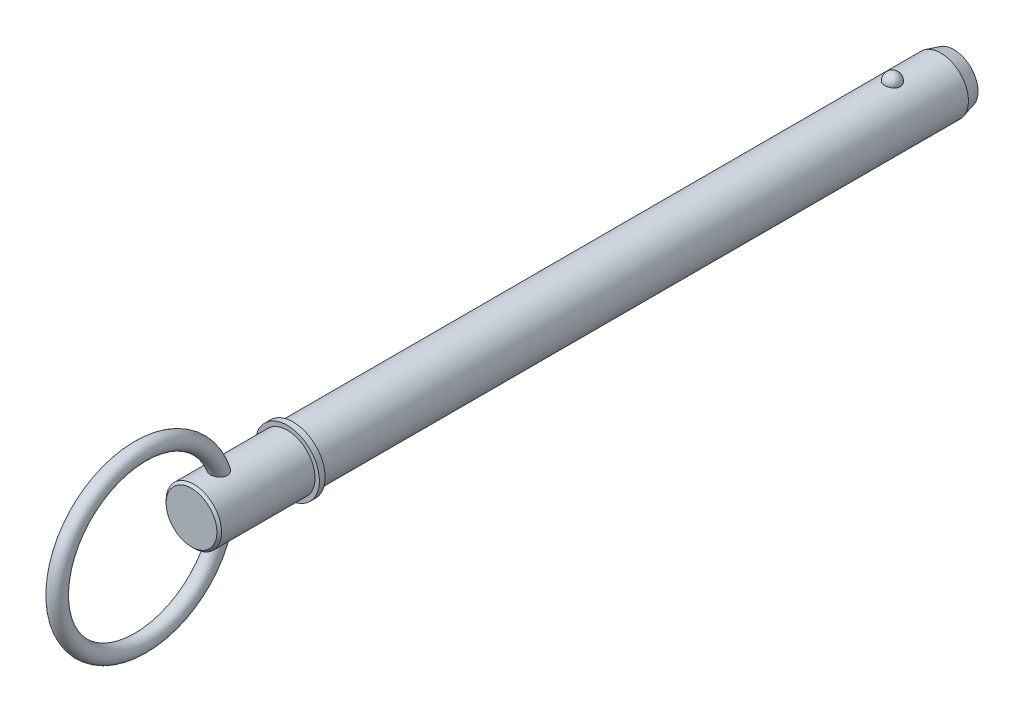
ISO-10303-21;
HEADER;
FILE_DESCRIPTION(('STEP AP214'),'2;1');
FILE_NAME('part.step','',(''),(''),'','','');
FILE_SCHEMA(('AUTOMOTIVE_DESIGN { 1 0 10303 214 1 1 1 1 }'));
ENDSEC;
DATA;
#1=APPLICATION_CONTEXT('core data for automotive mechanical design processes');
#2=APPLICATION_PROTOCOL_DEFINITION('international standard','automotive_design',2000,#1);
#3=PRODUCT_CONTEXT('',#1,'mechanical');
#4=PRODUCT('Part','Part','',(#3));
#5=PRODUCT_RELATED_PRODUCT_CATEGORY('part','',(#4));
#6=PRODUCT_DEFINITION_FORMATION('','',#4);
#7=PRODUCT_DEFINITION_CONTEXT('part definition',#1,'design');
#8=PRODUCT_DEFINITION('design','',#6,#7);
#9=PRODUCT_DEFINITION_SHAPE('','',#8);
#10=(LENGTH_UNIT() NAMED_UNIT(*) SI_UNIT(.MILLI.,.METRE.));
#11=(NAMED_UNIT(*) PLANE_ANGLE_UNIT() SI_UNIT($,.RADIAN.));
#12=(NAMED_UNIT(*) SI_UNIT($,.STERADIAN.) SOLID_ANGLE_UNIT());
#13=UNCERTAINTY_MEASURE_WITH_UNIT(LENGTH_MEASURE(1.E-05),#10,'distance_accuracy_value','');
#14=(GEOMETRIC_REPRESENTATION_CONTEXT(3) GLOBAL_UNCERTAINTY_ASSIGNED_CONTEXT((#13)) GLOBAL_UNIT_ASSIGNED_CONTEXT((#10,
#11,#12)) REPRESENTATION_CONTEXT('',''));
#15=CARTESIAN_POINT('',(0.,0.,0.));
#16=DIRECTION('',(0.,0.,1.));
#17=DIRECTION('',(1.,0.,0.));
#18=AXIS2_PLACEMENT_3D('',#15,#16,#17);
#19=CARTESIAN_POINT('',(0.,0.,203.2));
#20=DIRECTION('',(0.,0.,-1.));
#21=DIRECTION('',(-1.,0.,0.));
#22=AXIS2_PLACEMENT_3D('',#19,#20,#21);
#23=CYLINDRICAL_SURFACE('',#22,9.525);
#24=CARTESIAN_POINT('',(2.66304631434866,9.14515223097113,-2.68999999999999));
#25=CARTESIAN_POINT('',(2.66304388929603,9.14515434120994,-2.53964785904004));
#26=CARTESIAN_POINT('',(2.65079171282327,9.14874785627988,-2.38926509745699));
#27=CARTESIAN_POINT('',(2.60207590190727,9.16272073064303,-2.09276319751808));
#28=CARTESIAN_POINT('',(2.5656035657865,9.17310252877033,-1.94664561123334));
#29=CARTESIAN_POINT('',(2.469373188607,9.19947238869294,-1.66290124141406));
#30=CARTESIAN_POINT('',(2.40962536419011,9.215457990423,-1.52527076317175));
#31=CARTESIAN_POINT('',(2.26832639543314,9.25124900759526,-1.26225231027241));
#32=CARTESIAN_POINT('',(2.1867756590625,9.27105435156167,-1.13686410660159));
#33=CARTESIAN_POINT('',(2.00344089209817,9.3123948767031,-0.901158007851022));
#34=CARTESIAN_POINT('',(1.90155748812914,9.33393823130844,-0.790918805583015));
#35=CARTESIAN_POINT('',(1.68043702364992,9.37626794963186,-0.589299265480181));
#36=CARTESIAN_POINT('',(1.56119995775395,9.397054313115,-0.497918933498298));
#37=CARTESIAN_POINT('',(1.30893044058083,9.43549335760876,-0.336812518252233));
#38=CARTESIAN_POINT('',(1.17593917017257,9.45315498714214,-0.267024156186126));
#39=CARTESIAN_POINT('',(0.8995966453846,9.48344056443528,-0.150749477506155));
#40=CARTESIAN_POINT('',(0.756246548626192,9.49606507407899,-0.104260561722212));
#41=CARTESIAN_POINT('',(0.466048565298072,9.51468193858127,-0.0365733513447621));
#42=CARTESIAN_POINT('',(0.319312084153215,9.52079100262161,-0.014929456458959));
#43=CARTESIAN_POINT('',(0.0241592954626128,9.52611235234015,0.00395337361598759));
#44=CARTESIAN_POINT('',(-0.124256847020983,9.5253253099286,0.00119468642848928));
#45=CARTESIAN_POINT('',(-0.41628168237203,9.51700443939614,-0.0284230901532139));
#46=CARTESIAN_POINT('',(-0.559928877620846,9.50956858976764,-0.0549321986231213));
#47=CARTESIAN_POINT('',(-0.840604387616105,9.48887888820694,-0.130816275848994));
#48=CARTESIAN_POINT('',(-0.977632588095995,9.47562493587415,-0.180191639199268));
#49=CARTESIAN_POINT('',(-1.24212223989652,9.44460733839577,-0.300803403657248));
#50=CARTESIAN_POINT('',(-1.36952298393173,9.42681774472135,-0.372166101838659));
#51=CARTESIAN_POINT('',(-1.61053183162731,9.38864858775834,-0.534729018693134));
#52=CARTESIAN_POINT('',(-1.72413851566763,9.36826875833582,-0.625931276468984));
#53=CARTESIAN_POINT('',(-1.9367483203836,9.32666137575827,-0.827716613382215));
#54=CARTESIAN_POINT('',(-2.03542624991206,9.3054250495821,-0.938640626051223));
#55=CARTESIAN_POINT('',(-2.21301001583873,9.26480083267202,-1.17562728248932));
#56=CARTESIAN_POINT('',(-2.29191442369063,9.24541307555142,-1.3016910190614));
#57=CARTESIAN_POINT('',(-2.4288038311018,9.21040769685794,-1.56709947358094));
#58=CARTESIAN_POINT('',(-2.48653332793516,9.19483682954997,-1.70658229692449));
#59=CARTESIAN_POINT('',(-2.57830950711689,9.16952722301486,-1.99363485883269));
#60=CARTESIAN_POINT('',(-2.61235688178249,9.1597883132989,-2.14120436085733));
#61=CARTESIAN_POINT('',(-2.65582131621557,9.14728131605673,-2.43957517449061));
#62=CARTESIAN_POINT('',(-2.66534248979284,9.14448376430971,-2.59036007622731));
#63=CARTESIAN_POINT('',(-2.659816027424,9.1460926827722,-2.89143694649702));
#64=CARTESIAN_POINT('',(-2.64476907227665,9.15049895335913,-3.04172892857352));
#65=CARTESIAN_POINT('',(-2.59062526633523,9.16597303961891,-3.3367616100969));
#66=CARTESIAN_POINT('',(-2.55165119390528,9.17700684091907,-3.48152666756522));
#67=CARTESIAN_POINT('',(-2.45072334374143,9.20447158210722,-3.7622672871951));
#68=CARTESIAN_POINT('',(-2.38876863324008,9.22090274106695,-3.89824249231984));
#69=CARTESIAN_POINT('',(-2.24300082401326,9.25744165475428,-4.15838266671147));
#70=CARTESIAN_POINT('',(-2.15906901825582,9.27756919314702,-4.28247834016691));
#71=CARTESIAN_POINT('',(-1.97161008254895,9.31920445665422,-4.51460755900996));
#72=CARTESIAN_POINT('',(-1.86808218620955,9.34071223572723,-4.62264047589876));
#73=CARTESIAN_POINT('',(-1.64365852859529,9.38280712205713,-4.82005417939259));
#74=CARTESIAN_POINT('',(-1.52269814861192,9.40339041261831,-4.90936239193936));
#75=CARTESIAN_POINT('',(-1.26696810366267,9.44124442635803,-5.06628635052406));
#76=CARTESIAN_POINT('',(-1.13219941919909,9.45851538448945,-5.13390363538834));
#77=CARTESIAN_POINT('',(-0.854427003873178,9.48761400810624,-5.24478918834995));
#78=CARTESIAN_POINT('',(-0.711548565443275,9.49950757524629,-5.28835378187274));
#79=CARTESIAN_POINT('',(-0.420167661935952,9.51684639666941,-5.35116010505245));
#80=CARTESIAN_POINT('',(-0.271665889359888,9.52229244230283,-5.3704048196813));
#81=CARTESIAN_POINT('',(0.0236961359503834,9.52609381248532,-5.38387805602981));
#82=CARTESIAN_POINT('',(0.170533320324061,9.52458300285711,-5.37857884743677));
#83=CARTESIAN_POINT('',(0.461166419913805,9.51494050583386,-5.34419624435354));
#84=CARTESIAN_POINT('',(0.604962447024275,9.50680906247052,-5.31511372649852));
#85=CARTESIAN_POINT('',(0.884899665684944,9.48484202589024,-5.23415185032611));
#86=CARTESIAN_POINT('',(1.02106863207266,9.47102889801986,-5.18236222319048));
#87=CARTESIAN_POINT('',(1.28268503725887,9.43915933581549,-5.05742910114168));
#88=CARTESIAN_POINT('',(1.40813178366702,9.421102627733,-4.98428422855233));
#89=CARTESIAN_POINT('',(1.64690915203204,9.38233399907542,-4.8172920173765));
#90=CARTESIAN_POINT('',(1.76002050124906,9.36158508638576,-4.72313982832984));
#91=CARTESIAN_POINT('',(1.96897358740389,9.31987907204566,-4.51732444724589));
#92=CARTESIAN_POINT('',(2.06481234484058,9.29892193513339,-4.40565824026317));
#93=CARTESIAN_POINT('',(2.23837433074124,9.25869342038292,-4.16566572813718));
#94=CARTESIAN_POINT('',(2.31574652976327,9.23945848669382,-4.03707931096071));
#95=CARTESIAN_POINT('',(2.44818540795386,9.20525491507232,-3.76840633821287));
#96=CARTESIAN_POINT('',(2.50325979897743,9.19028480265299,-3.6283237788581));
#97=CARTESIAN_POINT('',(2.58510224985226,9.16757716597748,-3.35610038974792));
#98=CARTESIAN_POINT('',(2.61427951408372,9.15923447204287,-3.2247283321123));
#99=CARTESIAN_POINT('',(2.6532524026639,9.14802112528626,-2.95891229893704));
#100=CARTESIAN_POINT('',(2.66304848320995,9.1451503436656,-2.82446839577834));
#101=CARTESIAN_POINT('',(2.66304631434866,9.14515223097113,-2.68999999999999));
#102=B_SPLINE_CURVE_WITH_KNOTS('',3,(#24,#25,#26,#27,#28,#29,#30,#31,#32,#33,#34,#35,#36,#37,
#38,#39,#40,#41,#42,#43,#44,#45,#46,#47,#48,#49,#50,#51,#52,#53,#54,#55,#56,#57,#58,#59,#60,#61,
#62,#63,#64,#65,#66,#67,#68,#69,#70,#71,#72,#73,#74,#75,#76,#77,#78,#79,#80,#81,#82,#83,#84,#85,
#86,#87,#88,#89,#90,#91,#92,#93,#94,#95,#96,#97,#98,#99,#100,#101),.UNSPECIFIED.,.T.,.F.,(4,2,2,
2,2,2,2,2,2,2,2,2,2,2,2,2,2,2,2,2,2,2,2,2,2,2,2,2,2,2,2,2,2,2,2,2,2,2,4),(0.,0.450573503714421,
0.901308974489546,1.35184682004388,1.80237623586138,2.25516399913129,2.70795190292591,
3.15942136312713,3.61084044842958,4.0540301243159,4.49717661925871,4.9338984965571,
5.37062791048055,5.80991423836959,6.24924573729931,6.69708004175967,7.1449466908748,
7.5980522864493,8.0511446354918,8.50231041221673,8.95346368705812,9.40232106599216,
9.85119666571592,10.3025487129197,10.7539184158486,11.2070064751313,11.6600623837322,
12.1074045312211,12.5546917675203,12.9934085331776,13.4321091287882,13.8690915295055,
14.3061021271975,14.7499227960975,15.1938199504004,15.6455814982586,16.0971866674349,
16.5001694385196,16.9031427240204),.UNSPECIFIED.);
#103=CARTESIAN_POINT('',(2.66304631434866,9.14515223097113,-2.68999999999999));
#104=VERTEX_POINT('',#103);
#105=EDGE_CURVE('E101',#104,#104,#102,.T.);
#106=ORIENTED_EDGE('',*,*,#105,.T.);
#107=EDGE_LOOP('',(#106));
#108=FACE_BOUND('',#107,.T.);
#109=CARTESIAN_POINT('',(0.,0.,-19.2999999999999));
#110=DIRECTION('',(0.,0.,-1.));
#111=DIRECTION('',(-1.,0.,0.));
#112=AXIS2_PLACEMENT_3D('',#109,#110,#111);
#113=CIRCLE('',#112,9.525);
#114=CARTESIAN_POINT('',(-9.525,0.,-19.2999999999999));
#115=VERTEX_POINT('',#114);
#116=EDGE_CURVE('E109',#115,#115,#113,.F.);
#117=ORIENTED_EDGE('',*,*,#116,.T.);
#118=EDGE_LOOP('',(#117));
#119=FACE_BOUND('',#118,.T.);
#120=CARTESIAN_POINT('',(0.,0.,203.2));
#121=DIRECTION('',(0.,0.,1.));
#122=DIRECTION('',(1.,0.,0.));
#123=AXIS2_PLACEMENT_3D('',#120,#121,#122);
#124=CIRCLE('',#123,9.525);
#125=CARTESIAN_POINT('',(9.525,0.,203.2));
#126=VERTEX_POINT('',#125);
#127=EDGE_CURVE('E107',#126,#126,#124,.T.);
#128=ORIENTED_EDGE('',*,*,#127,.F.);
#129=EDGE_LOOP('',(#128));
#130=FACE_BOUND('',#129,.T.);
#131=ADVANCED_FACE('F39',(#108,#119,#130),#23,.T.);
#132=CARTESIAN_POINT('',(0.,0.,-23.8));
#133=DIRECTION('',(0.,0.,-1.));
#134=DIRECTION('',(-1.,0.,0.));
#135=AXIS2_PLACEMENT_3D('',#132,#133,#134);
#136=PLANE('',#135);
#137=CARTESIAN_POINT('',(0.,0.,-23.8));
#138=DIRECTION('',(0.,0.,-1.));
#139=DIRECTION('',(-1.,0.,0.));
#140=AXIS2_PLACEMENT_3D('',#137,#138,#139);
#141=CIRCLE('',#140,8.31922863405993);
#142=CARTESIAN_POINT('',(-8.31922863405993,0.,-23.8));
#143=VERTEX_POINT('',#142);
#144=EDGE_CURVE('E142',#143,#143,#141,.T.);
#145=ORIENTED_EDGE('',*,*,#144,.T.);
#146=EDGE_LOOP('',(#145));
#147=FACE_BOUND('',#146,.T.);
#148=ADVANCED_FACE('F87',(#147),#136,.T.);
#149=CARTESIAN_POINT('',(0.,0.,-23.8));
#150=DIRECTION('',(0.,0.,1.));
#151=DIRECTION('',(1.,0.,0.));
#152=AXIS2_PLACEMENT_3D('',#149,#150,#151);
#153=CONICAL_SURFACE('',#152,8.31922863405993,0.261799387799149);
#154=ORIENTED_EDGE('',*,*,#116,.F.);
#155=EDGE_LOOP('',(#154));
#156=FACE_BOUND('',#155,.T.);
#157=ORIENTED_EDGE('',*,*,#144,.F.);
#158=EDGE_LOOP('',(#157));
#159=FACE_BOUND('',#158,.T.);
#160=ADVANCED_FACE('F93',(#156,#159),#153,.T.);
#161=CARTESIAN_POINT('',(0.,9.525,-2.68999999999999));
#162=DIRECTION('',(0.,1.,0.));
#163=DIRECTION('',(0.,0.,1.));
#164=AXIS2_PLACEMENT_3D('',#161,#162,#163);
#165=SPHERICAL_SURFACE('',#164,2.69);
#166=ORIENTED_EDGE('',*,*,#105,.F.);
#167=EDGE_LOOP('',(#166));
#168=FACE_BOUND('',#167,.T.);
#169=ADVANCED_FACE('F112',(#168),#165,.T.);
#170=CARTESIAN_POINT('',(0.,0.,203.2));
#171=DIRECTION('',(0.,0.,-1.));
#172=DIRECTION('',(-1.,0.,0.));
#173=AXIS2_PLACEMENT_3D('',#170,#171,#172);
#174=PLANE('',#173);
#175=ORIENTED_EDGE('',*,*,#127,.T.);
#176=EDGE_LOOP('',(#175));
#177=FACE_BOUND('',#176,.T.);
#178=CARTESIAN_POINT('',(0.,0.,203.2));
#179=DIRECTION('',(0.,0.,-1.));
#180=DIRECTION('',(-1.,0.,0.));
#181=AXIS2_PLACEMENT_3D('',#178,#179,#180);
#182=CIRCLE('',#181,11.);
#183=CARTESIAN_POINT('',(-11.,0.,203.2));
#184=VERTEX_POINT('',#183);
#185=EDGE_CURVE('E108',#184,#184,#182,.T.);
#186=ORIENTED_EDGE('',*,*,#185,.T.);
#187=EDGE_LOOP('',(#186));
#188=FACE_BOUND('',#187,.T.);
#189=ADVANCED_FACE('F116',(#177,#188),#174,.T.);
#190=CARTESIAN_POINT('',(0.,0.,33.7287874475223));
#191=DIRECTION('',(0.,0.,-1.));
#192=DIRECTION('',(-1.,0.,0.));
#193=AXIS2_PLACEMENT_3D('',#190,#191,#192);
#194=CYLINDRICAL_SURFACE('',#193,11.);
#195=CARTESIAN_POINT('',(0.,0.,205.2));
#196=DIRECTION('',(0.,0.,-1.));
#197=DIRECTION('',(-1.,0.,0.));
#198=AXIS2_PLACEMENT_3D('',#195,#196,#197);
#199=CIRCLE('',#198,11.);
#200=CARTESIAN_POINT('',(-11.,0.,205.2));
#201=VERTEX_POINT('',#200);
#202=EDGE_CURVE('E133',#201,#201,#199,.T.);
#203=ORIENTED_EDGE('',*,*,#202,.T.);
#204=EDGE_LOOP('',(#203));
#205=FACE_BOUND('',#204,.T.);
#206=ORIENTED_EDGE('',*,*,#185,.F.);
#207=EDGE_LOOP('',(#206));
#208=FACE_BOUND('',#207,.T.);
#209=ADVANCED_FACE('F120',(#205,#208),#194,.T.);
#210=CARTESIAN_POINT('',(0.,11.,205.2));
#211=DIRECTION('',(0.,0.,1.));
#212=DIRECTION('',(1.,0.,0.));
#213=AXIS2_PLACEMENT_3D('',#210,#211,#212);
#214=PLANE('',#213);
#215=CARTESIAN_POINT('',(0.,0.,205.2));
#216=DIRECTION('',(0.,0.,1.));
#217=DIRECTION('',(1.,0.,0.));
#218=AXIS2_PLACEMENT_3D('',#215,#216,#217);
#219=CIRCLE('',#218,9.525);
#220=CARTESIAN_POINT('',(9.525,0.,205.2));
#221=VERTEX_POINT('',#220);
#222=EDGE_CURVE('E111',#221,#221,#219,.T.);
#223=ORIENTED_EDGE('',*,*,#222,.F.);
#224=EDGE_LOOP('',(#223));
#225=FACE_BOUND('',#224,.T.);
#226=ORIENTED_EDGE('',*,*,#202,.F.);
#227=EDGE_LOOP('',(#226));
#228=FACE_BOUND('',#227,.T.);
#229=ADVANCED_FACE('F84',(#225,#228),#214,.T.);
#230=CARTESIAN_POINT('',(0.,0.,238.13));
#231=DIRECTION('',(0.,0.,-1.));
#232=DIRECTION('',(-1.,0.,0.));
#233=AXIS2_PLACEMENT_3D('',#230,#231,#232);
#234=CYLINDRICAL_SURFACE('',#233,9.525);
#235=CARTESIAN_POINT('',(-1.1725502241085,-9.45255262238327,226.115681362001));
#236=CARTESIAN_POINT('',(-1.03279041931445,-9.46988901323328,226.052058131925));
#237=CARTESIAN_POINT('',(-0.887457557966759,-9.48474288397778,226.000036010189));
#238=CARTESIAN_POINT('',(-0.589790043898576,-9.50789357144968,225.920301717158));
#239=CARTESIAN_POINT('',(-0.437456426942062,-9.51619135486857,225.892585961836));
#240=CARTESIAN_POINT('',(-0.130095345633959,-9.52535230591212,225.862037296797));
#241=CARTESIAN_POINT('',(0.0249321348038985,-9.52621542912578,225.859204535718));
#242=CARTESIAN_POINT('',(0.333291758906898,-9.5204161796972,225.878480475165));
#243=CARTESIAN_POINT('',(0.486623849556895,-9.51375357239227,225.900589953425));
#244=CARTESIAN_POINT('',(0.787326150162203,-9.49360162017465,225.969309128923));
#245=CARTESIAN_POINT('',(0.934692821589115,-9.48010828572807,226.015933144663));
#246=CARTESIAN_POINT('',(1.21917062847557,-9.44773819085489,226.132695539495));
#247=CARTESIAN_POINT('',(1.3562816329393,-9.42886136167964,226.202834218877));
#248=CARTESIAN_POINT('',(1.61597534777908,-9.38783836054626,226.364858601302));
#249=CARTESIAN_POINT('',(1.73859309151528,-9.36570037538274,226.456690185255));
#250=CARTESIAN_POINT('',(1.9661192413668,-9.32059424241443,226.659983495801));
#251=CARTESIAN_POINT('',(2.07103000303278,-9.29762620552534,226.771442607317));
#252=CARTESIAN_POINT('',(2.25895856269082,-9.25375378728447,227.009567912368));
#253=CARTESIAN_POINT('',(2.34223089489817,-9.23282741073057,227.136029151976));
#254=CARTESIAN_POINT('',(2.48638570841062,-9.19505802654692,227.401654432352));
#255=CARTESIAN_POINT('',(2.54727152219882,-9.17821441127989,227.540816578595));
#256=CARTESIAN_POINT('',(2.64504150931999,-9.15051673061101,227.826450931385));
#257=CARTESIAN_POINT('',(2.68213620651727,-9.13961026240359,227.97284631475));
#258=CARTESIAN_POINT('',(2.73308631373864,-9.1245038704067,228.269935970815));
#259=CARTESIAN_POINT('',(2.74693762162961,-9.12030513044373,228.420630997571));
#260=CARTESIAN_POINT('',(2.75225289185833,-9.11870262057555,228.728204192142));
#261=CARTESIAN_POINT('',(2.74283577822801,-9.12156626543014,228.885097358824));
#262=CARTESIAN_POINT('',(2.70120500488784,-9.13397864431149,229.195530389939));
#263=CARTESIAN_POINT('',(2.6689831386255,-9.14352978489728,229.349069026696));
#264=CARTESIAN_POINT('',(2.57915721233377,-9.1692947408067,229.664317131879));
#265=CARTESIAN_POINT('',(2.51938387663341,-9.18606757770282,229.82536274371));
#266=CARTESIAN_POINT('',(2.37615490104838,-9.22415241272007,230.136112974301));
#267=CARTESIAN_POINT('',(2.29267648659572,-9.24546877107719,230.285806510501));
#268=CARTESIAN_POINT('',(2.09570343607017,-9.29218719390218,230.582005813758));
#269=CARTESIAN_POINT('',(1.98029238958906,-9.3177815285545,230.727215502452));
#270=CARTESIAN_POINT('',(1.72523060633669,-9.36835235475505,230.994631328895));
#271=CARTESIAN_POINT('',(1.58560973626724,-9.39332956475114,231.11686542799));
#272=CARTESIAN_POINT('',(1.31999418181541,-9.4338116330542,231.306542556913));
#273=CARTESIAN_POINT('',(1.19849876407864,-9.4501635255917,231.380111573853));
#274=CARTESIAN_POINT('',(0.944726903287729,-9.47889043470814,231.506555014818));
#275=CARTESIAN_POINT('',(0.812460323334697,-9.4912690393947,231.55944811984));
#276=CARTESIAN_POINT('',(0.539385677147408,-9.51070487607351,231.641579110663));
#277=CARTESIAN_POINT('',(0.398529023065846,-9.51772807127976,231.670665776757));
#278=CARTESIAN_POINT('',(0.113692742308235,-9.52538430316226,231.70234627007));
#279=CARTESIAN_POINT('',(-0.0302854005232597,-9.52602031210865,231.704952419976));
#280=CARTESIAN_POINT('',(-0.301067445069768,-9.52110324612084,231.684638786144));
#281=CARTESIAN_POINT('',(-0.428091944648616,-9.51619084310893,231.664361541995));
#282=CARTESIAN_POINT('',(-0.676960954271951,-9.50173118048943,231.603770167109));
#283=CARTESIAN_POINT('',(-0.798804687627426,-9.49218322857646,231.563453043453));
#284=CARTESIAN_POINT('',(-1.03743276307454,-9.4691126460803,231.463797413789));
#285=CARTESIAN_POINT('',(-1.15402581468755,-9.45550022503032,231.404026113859));
#286=CARTESIAN_POINT('',(-1.37707059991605,-9.42560278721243,231.268465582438));
#287=CARTESIAN_POINT('',(-1.48351822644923,-9.40931669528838,231.192669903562));
#288=CARTESIAN_POINT('',(-1.70022776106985,-9.37276249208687,231.015206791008));
#289=CARTESIAN_POINT('',(-1.80866644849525,-9.35226352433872,230.911363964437));
#290=CARTESIAN_POINT('',(-2.00947431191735,-9.31118474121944,230.68916467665));
#291=CARTESIAN_POINT('',(-2.10183201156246,-9.29060487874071,230.570797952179));
#292=CARTESIAN_POINT('',(-2.28343646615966,-9.24779116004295,230.301723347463));
#293=CARTESIAN_POINT('',(-2.36963977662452,-9.22584708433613,230.148904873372));
#294=CARTESIAN_POINT('',(-2.51731958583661,-9.18665215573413,229.831108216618));
#295=CARTESIAN_POINT('',(-2.57878214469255,-9.16940395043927,229.666123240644));
#296=CARTESIAN_POINT('',(-2.67771284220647,-9.14102404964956,229.317906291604));
#297=CARTESIAN_POINT('',(-2.71355979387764,-9.13031106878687,229.134171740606));
#298=CARTESIAN_POINT('',(-2.75239325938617,-9.11868499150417,228.762939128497));
#299=CARTESIAN_POINT('',(-2.75540326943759,-9.11776488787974,228.575443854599));
#300=CARTESIAN_POINT('',(-2.72755769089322,-9.12612848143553,228.218233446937));
#301=CARTESIAN_POINT('',(-2.69938579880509,-9.13460365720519,228.048293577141));
#302=CARTESIAN_POINT('',(-2.61282341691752,-9.15973790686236,227.71694195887));
#303=CARTESIAN_POINT('',(-2.55445306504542,-9.17639152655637,227.555524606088));
#304=CARTESIAN_POINT('',(-2.4157506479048,-9.21381352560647,227.262262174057));
#305=CARTESIAN_POINT('',(-2.33810564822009,-9.23402440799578,227.129067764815));
#306=CARTESIAN_POINT('',(-2.16110598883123,-9.27704240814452,226.878436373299));
#307=CARTESIAN_POINT('',(-2.06174995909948,-9.29984968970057,226.76100038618));
#308=CARTESIAN_POINT('',(-1.84046167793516,-9.34620233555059,226.541444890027));
#309=CARTESIAN_POINT('',(-1.71787459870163,-9.36974632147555,226.43998498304));
#310=CARTESIAN_POINT('',(-1.45637301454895,-9.41393415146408,226.260085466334));
#311=CARTESIAN_POINT('',(-1.31745717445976,-9.43457775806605,226.181647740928));
#312=CARTESIAN_POINT('',(-1.1725502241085,-9.45255262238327,226.115681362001));
#313=B_SPLINE_CURVE_WITH_KNOTS('',3,(#235,#236,#237,#238,#239,#240,#241,#242,#243,#244,#245,
#246,#247,#248,#249,#250,#251,#252,#253,#254,#255,#256,#257,#258,#259,#260,#261,#262,#263,#264,
#265,#266,#267,#268,#269,#270,#271,#272,#273,#274,#275,#276,#277,#278,#279,#280,#281,#282,#283,
#284,#285,#286,#287,#288,#289,#290,#291,#292,#293,#294,#295,#296,#297,#298,#299,#300,#301,#302,
#303,#304,#305,#306,#307,#308,#309,#310,#311,#312),.UNSPECIFIED.,.T.,.F.,(4,2,2,2,2,2,2,2,2,2,2,
2,2,2,2,2,2,2,2,2,2,2,2,2,2,2,2,2,2,2,2,2,2,2,2,2,2,2,4),(0.,0.463035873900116,
0.926003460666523,1.38897381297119,1.85195860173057,2.31521411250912,2.77847553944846,
3.24059321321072,3.70264936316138,4.15899535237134,4.6152733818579,5.06745604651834,
5.51971850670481,5.98936669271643,6.4591839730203,6.97482863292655,7.49097038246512,
8.049956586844,8.60825803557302,9.03545685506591,9.46226879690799,9.89177127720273,
10.3210738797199,10.7054535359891,11.0898906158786,11.4835430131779,11.8773540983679,
12.3302409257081,12.7834496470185,13.311649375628,13.8401462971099,14.3996817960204,
14.9588168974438,15.4733264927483,15.9874934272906,16.451669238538,16.915874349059,
17.3959238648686,17.8760126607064),.UNSPECIFIED.);
#314=CARTESIAN_POINT('',(-1.1725502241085,-9.45255262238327,226.115681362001));
#315=VERTEX_POINT('',#314);
#316=EDGE_CURVE('E10',#315,#315,#313,.T.);
#317=ORIENTED_EDGE('',*,*,#316,.F.);
#318=EDGE_LOOP('',(#317));
#319=FACE_BOUND('',#318,.T.);
#320=CARTESIAN_POINT('',(-1.1725502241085,9.45255262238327,226.115681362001));
#321=CARTESIAN_POINT('',(-1.31058061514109,9.43543238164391,226.178514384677));
#322=CARTESIAN_POINT('',(-1.44315063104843,9.41589375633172,226.252651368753));
#323=CARTESIAN_POINT('',(-1.6936534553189,9.37407591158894,226.421892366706));
#324=CARTESIAN_POINT('',(-1.81158925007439,9.35179725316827,226.516992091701));
#325=CARTESIAN_POINT('',(-2.02956633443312,9.30692788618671,226.72596768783));
#326=CARTESIAN_POINT('',(-2.12959463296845,9.28433696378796,226.839857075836));
#327=CARTESIAN_POINT('',(-2.30883055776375,9.24139869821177,227.08334578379));
#328=CARTESIAN_POINT('',(-2.38804080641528,9.22105107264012,227.212943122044));
#329=CARTESIAN_POINT('',(-2.52289811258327,9.18506690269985,227.482637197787));
#330=CARTESIAN_POINT('',(-2.57879510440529,9.16938093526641,227.622602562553));
#331=CARTESIAN_POINT('',(-2.66732862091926,9.14402087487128,227.910194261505));
#332=CARTESIAN_POINT('',(-2.69996436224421,9.13434698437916,228.057820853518));
#333=CARTESIAN_POINT('',(-2.74234854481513,9.12171311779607,228.358709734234));
#334=CARTESIAN_POINT('',(-2.75176419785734,9.11885078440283,228.512022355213));
#335=CARTESIAN_POINT('',(-2.74768995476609,9.12007747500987,228.818282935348));
#336=CARTESIAN_POINT('',(-2.73419331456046,9.12416854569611,228.971230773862));
#337=CARTESIAN_POINT('',(-2.68381401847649,9.13911977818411,229.285048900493));
#338=CARTESIAN_POINT('',(-2.64520186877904,9.15047943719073,229.445615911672));
#339=CARTESIAN_POINT('',(-2.54485320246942,9.17889121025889,229.758878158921));
#340=CARTESIAN_POINT('',(-2.48309922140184,9.19594762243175,229.911567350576));
#341=CARTESIAN_POINT('',(-2.33056913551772,9.23584987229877,230.221122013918));
#342=CARTESIAN_POINT('',(-2.23745101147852,9.25911216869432,230.376784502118));
#343=CARTESIAN_POINT('',(-2.02674425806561,9.30750138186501,230.670279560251));
#344=CARTESIAN_POINT('',(-1.90916388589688,9.33262766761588,230.808118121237));
#345=CARTESIAN_POINT('',(-1.67044606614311,9.37804498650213,231.042015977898));
#346=CARTESIAN_POINT('',(-1.55243875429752,9.39849934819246,231.141240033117));
#347=CARTESIAN_POINT('',(-1.30125310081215,9.43654625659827,231.319193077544));
#348=CARTESIAN_POINT('',(-1.16808326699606,9.45414039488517,231.397933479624));
#349=CARTESIAN_POINT('',(-0.958516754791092,9.47691412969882,231.497606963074));
#350=CARTESIAN_POINT('',(-0.88664963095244,9.48392776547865,231.527860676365));
#351=CARTESIAN_POINT('',(-0.740281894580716,9.49647248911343,231.581484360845));
#352=CARTESIAN_POINT('',(-0.665782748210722,9.50200438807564,231.604858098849));
#353=CARTESIAN_POINT('',(-0.514804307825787,9.51137811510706,231.6442294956));
#354=CARTESIAN_POINT('',(-0.438326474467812,9.51522115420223,231.660232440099));
#355=CARTESIAN_POINT('',(-0.284116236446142,9.52107513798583,231.684532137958));
#356=CARTESIAN_POINT('',(-0.206384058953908,9.52308641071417,231.692830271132));
#357=CARTESIAN_POINT('',(0.0046395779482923,9.5259225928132,231.704545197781));
#358=CARTESIAN_POINT('',(0.13846054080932,9.52491109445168,231.700394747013));
#359=CARTESIAN_POINT('',(0.403152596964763,9.51738801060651,231.669251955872));
#360=CARTESIAN_POINT('',(0.534023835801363,9.51087669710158,231.642260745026));
#361=CARTESIAN_POINT('',(0.783985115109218,9.49347484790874,231.568806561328));
#362=CARTESIAN_POINT('',(0.903337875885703,9.48277338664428,231.523181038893));
#363=CARTESIAN_POINT('',(1.13363663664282,9.45800893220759,231.414928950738));
#364=CARTESIAN_POINT('',(1.24458027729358,9.44394500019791,231.352297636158));
#365=CARTESIAN_POINT('',(1.46880911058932,9.41182796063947,231.204389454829));
#366=CARTESIAN_POINT('',(1.58087386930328,9.3935013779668,231.117328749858));
#367=CARTESIAN_POINT('',(1.79132420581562,9.35565274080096,230.928247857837));
#368=CARTESIAN_POINT('',(1.88970126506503,9.33612995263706,230.826218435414));
#369=CARTESIAN_POINT('',(2.08778125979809,9.29401761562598,230.590997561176));
#370=CARTESIAN_POINT('',(2.18473298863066,9.27148591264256,230.45547341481));
#371=CARTESIAN_POINT('',(2.35733954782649,9.22911075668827,230.171030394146));
#372=CARTESIAN_POINT('',(2.43297838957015,9.20926932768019,230.022101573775));
#373=CARTESIAN_POINT('',(2.56843139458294,9.17247322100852,229.697269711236));
#374=CARTESIAN_POINT('',(2.62561924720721,9.15606955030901,229.520196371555));
#375=CARTESIAN_POINT('',(2.70930664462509,9.13166037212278,229.158330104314));
#376=CARTESIAN_POINT('',(2.73581406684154,9.12365270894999,228.973539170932));
#377=CARTESIAN_POINT('',(2.7551261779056,9.11784049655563,228.609017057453));
#378=CARTESIAN_POINT('',(2.74917791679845,9.11965839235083,228.429361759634));
#379=CARTESIAN_POINT('',(2.70473277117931,9.13294027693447,228.074499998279));
#380=CARTESIAN_POINT('',(2.66626406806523,9.14439591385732,227.899289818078));
#381=CARTESIAN_POINT('',(2.56263844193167,9.17393184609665,227.578469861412));
#382=CARTESIAN_POINT('',(2.5008006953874,9.19116614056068,227.431704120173));
#383=CARTESIAN_POINT('',(2.35244847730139,9.23024728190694,227.15189992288));
#384=CARTESIAN_POINT('',(2.26593972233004,9.25209305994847,227.018858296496));
#385=CARTESIAN_POINT('',(2.07585352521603,9.29652853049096,226.777145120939));
#386=CARTESIAN_POINT('',(1.97340753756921,9.31901931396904,226.667562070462));
#387=CARTESIAN_POINT('',(1.75142335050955,9.36327537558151,226.467179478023));
#388=CARTESIAN_POINT('',(1.63188535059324,9.38504066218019,226.376379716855));
#389=CARTESIAN_POINT('',(1.37826267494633,9.42563474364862,226.215168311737));
#390=CARTESIAN_POINT('',(1.24409194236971,9.44444438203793,226.144887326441));
#391=CARTESIAN_POINT('',(0.965562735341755,9.47697010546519,226.026996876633));
#392=CARTESIAN_POINT('',(0.821203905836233,9.4906860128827,225.979388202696));
#393=CARTESIAN_POINT('',(0.524366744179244,9.51173338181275,225.907369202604));
#394=CARTESIAN_POINT('',(0.371807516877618,9.5189799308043,225.883267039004));
#395=CARTESIAN_POINT('',(0.0646112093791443,9.52602042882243,225.859842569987));
#396=CARTESIAN_POINT('',(-0.0900262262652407,9.52581308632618,225.860524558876));
#397=CARTESIAN_POINT('',(-0.40413981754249,9.51777767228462,225.887276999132));
#398=CARTESIAN_POINT('',(-0.563508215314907,9.50959696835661,225.91452226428));
#399=CARTESIAN_POINT('',(-0.874799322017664,9.48602809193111,225.995533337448));
#400=CARTESIAN_POINT('',(-1.0267221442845,9.47064002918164,226.04929874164));
#401=CARTESIAN_POINT('',(-1.1725502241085,9.45255262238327,226.115681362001));
#402=B_SPLINE_CURVE_WITH_KNOTS('',3,(#320,#321,#322,#323,#324,#325,#326,#327,#328,#329,#330,
#331,#332,#333,#334,#335,#336,#337,#338,#339,#340,#341,#342,#343,#344,#345,#346,#347,#348,#349,
#350,#351,#352,#353,#354,#355,#356,#357,#358,#359,#360,#361,#362,#363,#364,#365,#366,#367,#368,
#369,#370,#371,#372,#373,#374,#375,#376,#377,#378,#379,#380,#381,#382,#383,#384,#385,#386,#387,
#388,#389,#390,#391,#392,#393,#394,#395,#396,#397,#398,#399,#400,#401),.UNSPECIFIED.,.T.,.F.,(4,
2,2,2,2,2,2,2,2,2,2,2,2,2,2,2,2,2,2,2,2,2,2,2,2,2,2,2,2,2,2,2,2,2,2,2,2,2,2,2,4),(0.,
0.457306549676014,0.914519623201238,1.37206305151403,1.82954881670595,2.28199545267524,
2.73445732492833,3.19336710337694,3.65241198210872,4.14699278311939,4.64194758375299,
5.18812269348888,5.73411374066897,6.19889752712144,6.66342179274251,6.89799214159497,
7.13243382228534,7.36670711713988,7.60093844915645,8.00032434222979,8.39969048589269,
8.78279802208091,9.16601265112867,9.59366701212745,10.0215863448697,10.5240084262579,
11.0268064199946,11.5844522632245,12.1419548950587,12.6781910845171,13.213963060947,
13.6920531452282,14.1700325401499,14.6229745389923,15.0759112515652,15.5316722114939,
15.9874490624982,16.4491237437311,16.91087841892,17.3940267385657,17.8771677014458),.UNSPECIFIED.);
#403=CARTESIAN_POINT('',(-1.1725502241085,9.45255262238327,226.115681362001));
#404=VERTEX_POINT('',#403);
#405=EDGE_CURVE('E51',#404,#404,#402,.T.);
#406=ORIENTED_EDGE('',*,*,#405,.F.);
#407=EDGE_LOOP('',(#406));
#408=FACE_BOUND('',#407,.T.);
#409=CARTESIAN_POINT('',(0.,0.,237.33));
#410=DIRECTION('',(0.,0.,-1.));
#411=DIRECTION('',(-1.,0.,0.));
#412=AXIS2_PLACEMENT_3D('',#409,#410,#411);
#413=CIRCLE('',#412,9.525);
#414=CARTESIAN_POINT('',(-9.525,0.,237.33));
#415=VERTEX_POINT('',#414);
#416=EDGE_CURVE('E63',#415,#415,#413,.T.);
#417=ORIENTED_EDGE('',*,*,#416,.T.);
#418=EDGE_LOOP('',(#417));
#419=FACE_BOUND('',#418,.T.);
#420=ORIENTED_EDGE('',*,*,#222,.T.);
#421=EDGE_LOOP('',(#420));
#422=FACE_BOUND('',#421,.T.);
#423=ADVANCED_FACE('F68',(#319,#408,#419,#422),#234,.T.);
#424=CARTESIAN_POINT('',(0.,0.,238.13));
#425=DIRECTION('',(0.,0.,-1.));
#426=DIRECTION('',(-1.,0.,0.));
#427=AXIS2_PLACEMENT_3D('',#424,#425,#426);
#428=PLANE('',#427);
#429=CARTESIAN_POINT('',(0.,0.,238.13));
#430=DIRECTION('',(0.,0.,-1.));
#431=DIRECTION('',(-1.,0.,0.));
#432=AXIS2_PLACEMENT_3D('',#429,#430,#431);
#433=CIRCLE('',#432,8.72500000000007);
#434=CARTESIAN_POINT('',(-8.72500000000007,0.,238.13));
#435=VERTEX_POINT('',#434);
#436=EDGE_CURVE('E57',#435,#435,#433,.F.);
#437=ORIENTED_EDGE('',*,*,#436,.T.);
#438=EDGE_LOOP('',(#437));
#439=FACE_BOUND('',#438,.T.);
#440=ADVANCED_FACE('F75',(#439),#428,.F.);
#441=CARTESIAN_POINT('',(0.,0.,237.33));
#442=DIRECTION('',(0.,0.,-1.));
#443=DIRECTION('',(-1.,0.,0.));
#444=AXIS2_PLACEMENT_3D('',#441,#442,#443);
#445=CONICAL_SURFACE('',#444,9.525,0.785398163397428);
#446=ORIENTED_EDGE('',*,*,#436,.F.);
#447=EDGE_LOOP('',(#446));
#448=FACE_BOUND('',#447,.T.);
#449=ORIENTED_EDGE('',*,*,#416,.F.);
#450=EDGE_LOOP('',(#449));
#451=FACE_BOUND('',#450,.T.);
#452=ADVANCED_FACE('F41',(#448,#451),#445,.T.);
#453=CARTESIAN_POINT('',(0.,0.,255.705));
#454=DIRECTION('',(1.,0.,0.));
#455=DIRECTION('',(0.,0.,-1.));
#456=AXIS2_PLACEMENT_3D('',#453,#454,#455);
#457=TOROIDAL_SURFACE('',#456,28.575,2.75);
#458=ORIENTED_EDGE('',*,*,#316,.T.);
#459=EDGE_LOOP('',(#458));
#460=FACE_BOUND('',#459,.T.);
#461=ORIENTED_EDGE('',*,*,#405,.T.);
#462=EDGE_LOOP('',(#461));
#463=FACE_BOUND('',#462,.T.);
#464=ADVANCED_FACE('F72',(#460,#463),#457,.T.);
#465=CLOSED_SHELL('',(#131,#148,#160,#169,#189,#209,#229,#423,#440,#452,#464));
#466=MANIFOLD_SOLID_BREP('B2',#465);
#467=ADVANCED_BREP_SHAPE_REPRESENTATION('',(#18,#466),#14);
#468=SHAPE_DEFINITION_REPRESENTATION(#9,#467);
ENDSEC;
END-ISO-10303-21;
